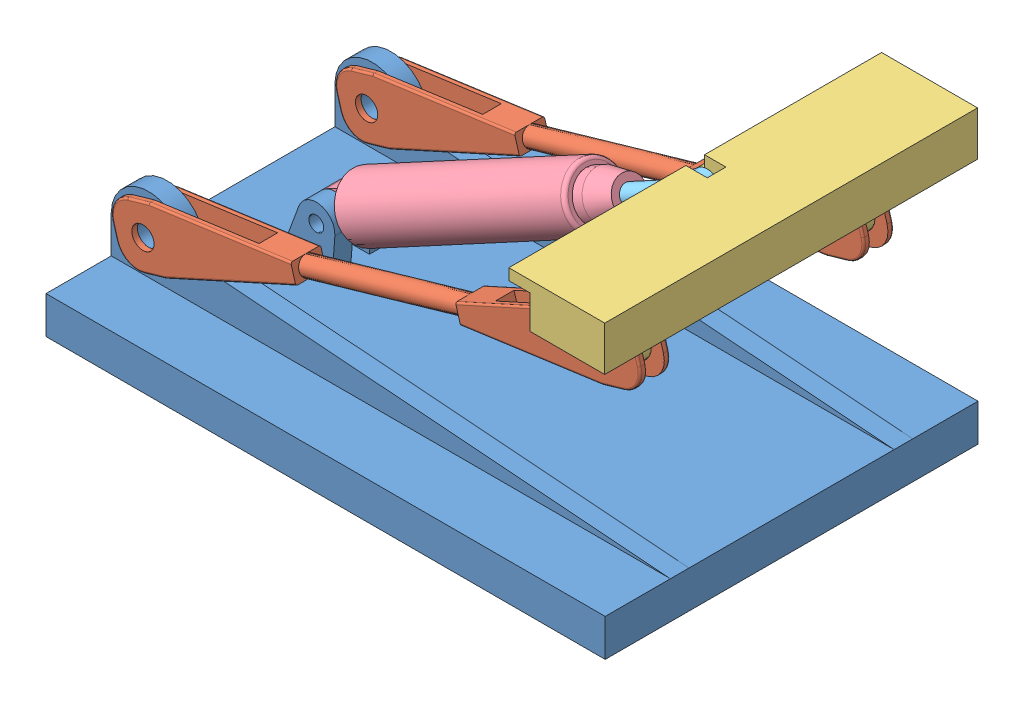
SolidWorks assembly assemblage relevage.SLDASM, configuration Défaut (file format 4700). Lengths in mm.
Overall size (1500 786.18 1000).
6 component instances, 5 part files, 12 mates.
Components (placement in the parent):
- socle-1: socle.SLDPRT [Défaut] at (-772.2118 -54.892 0) size (1500 300 1000)
- bras-1: bras.SLDPRT [Défaut] at (-672.2118 45.108 -300) x (0.960586 0.277982 0) z (0 0 1) size (1460 160 80)
- bras-2: bras.SLDPRT [Défaut] at (-672.2118 45.108 300) x (0.960586 0.277982 0) z (0 0 1) size (1460 160 80)
- support-1: support.SLDPRT [Défaut] at (626.5505 506.4841 0) size (290 269.32 1000)
- corps verin-1: corps verin.SLDPRT [Défaut] at (-410.5925 78.3204 0) x (0.880276 0.474462 0) z (0 0 1) size (920 160 160)
- tige piston-1: tige piston.SLDPRT [Défaut] at (423.734 528.0164 0) x (-0.880276 -0.474462 0) z (0 0 -1) size (400 126.85 154.06)
Mates (geometry in assembly coordinates):
- Coïncidente1: coincident anti-aligned: plane of socle-1 through (-672.2118 45.108 275) normal (0 0 -1); plane of bras-2 through (-726.8202 -53.9774 275) normal (0 0 1)
- Coïncidente2: coincident anti-aligned: plane of socle-1 through (-672.2118 45.108 -325) normal (0 0 -1); plane of bras-1 through (-726.8202 -53.9774 -325) normal (0 0 1)
- Coaxiale4: concentric aligned: cylinder of socle-1 through (-672.2118 45.108 -500) axis (0 0 1) radius 30; cylinder of bras-2 through (-672.2118 45.108 260) axis (0 0 1) radius 30
- Coaxiale5: concentric aligned: cylinder of socle-1 through (-672.2118 45.108 -500) axis (0 0 1) radius 30; cylinder of bras-1 through (-672.2118 45.108 -340) axis (0 0 1) radius 30
- Coïncidente4: coincident anti-aligned: plane of bras-1 through (675.636 351.8757 -275) normal (0 0 -1); plane of support-1 through (576.5505 406.4841 -275) normal (0 0 1)
- Coaxiale10: concentric anti-aligned: cylinder of bras-2 through (576.5505 406.4841 260) axis (0 0 1) radius 30; cylinder of support-1 through (576.5505 406.4841 500) axis (0 0 -1) radius 30
- Coaxiale11: concentric anti-aligned: cylinder of bras-1 through (576.5505 406.4841 -340) axis (0 0 1) radius 30; cylinder of support-1 through (576.5505 406.4841 500) axis (0 0 -1) radius 30
- Coaxiale12: concentric aligned: cylinder of corps verin-1 through (-58.4822 268.1053 0) axis (0.880276 0.474462 0) radius 25; cylinder of tige piston-1 through (159.6512 385.6777 0) axis (0.880276 0.474462 0) radius 25
- Coïncidente5: coincident anti-aligned: plane of socle-1 through (-472.2118 45.108 25) normal (0 0 -1); plane of corps verin-1 through (-472.2118 45.108 25) normal (0 0 1)
- Coaxiale13: concentric anti-aligned: cylinder of socle-1 through (-472.2118 45.108 -75) axis (0 0 1) radius 20; cylinder of corps verin-1 through (-472.2118 45.108 25) axis (0 0 -1) radius 20
- Coaxiale14: concentric aligned: cylinder of support-1 through (476.5505 556.4841 -500) axis (0 0 1) radius 20; cylinder of tige piston-1 through (476.5505 556.4841 -25) axis (0 0 1) radius 20
- Parallèle1: parallel aligned: plane of socle-1 through (-772.2118 -54.892 500) normal (0 1 0); plane of support-1 through (469.2267 625.8079 -500) normal (0 1 0)
